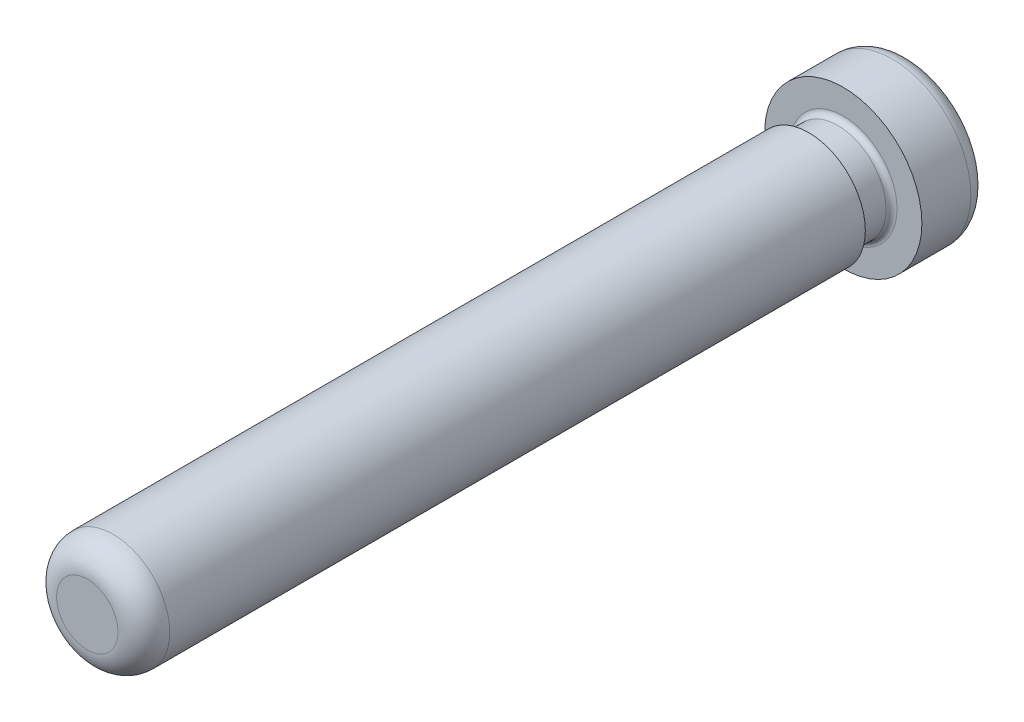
ISO-10303-21;
HEADER;
FILE_DESCRIPTION(('STEP AP214'),'2;1');
FILE_NAME('part.step','',(''),(''),'','','');
FILE_SCHEMA(('AUTOMOTIVE_DESIGN { 1 0 10303 214 1 1 1 1 }'));
ENDSEC;
DATA;
#1=APPLICATION_CONTEXT('core data for automotive mechanical design processes');
#2=APPLICATION_PROTOCOL_DEFINITION('international standard','automotive_design',2000,#1);
#3=PRODUCT_CONTEXT('',#1,'mechanical');
#4=PRODUCT('Part','Part','',(#3));
#5=PRODUCT_RELATED_PRODUCT_CATEGORY('part','',(#4));
#6=PRODUCT_DEFINITION_FORMATION('','',#4);
#7=PRODUCT_DEFINITION_CONTEXT('part definition',#1,'design');
#8=PRODUCT_DEFINITION('design','',#6,#7);
#9=PRODUCT_DEFINITION_SHAPE('','',#8);
#10=(LENGTH_UNIT() NAMED_UNIT(*) SI_UNIT(.MILLI.,.METRE.));
#11=(NAMED_UNIT(*) PLANE_ANGLE_UNIT() SI_UNIT($,.RADIAN.));
#12=(NAMED_UNIT(*) SI_UNIT($,.STERADIAN.) SOLID_ANGLE_UNIT());
#13=UNCERTAINTY_MEASURE_WITH_UNIT(LENGTH_MEASURE(1.E-05),#10,'distance_accuracy_value','');
#14=(GEOMETRIC_REPRESENTATION_CONTEXT(3) GLOBAL_UNCERTAINTY_ASSIGNED_CONTEXT((#13)) GLOBAL_UNIT_ASSIGNED_CONTEXT((#10,
#11,#12)) REPRESENTATION_CONTEXT('',''));
#15=CARTESIAN_POINT('',(0.,0.,0.));
#16=DIRECTION('',(0.,0.,1.));
#17=DIRECTION('',(1.,0.,0.));
#18=AXIS2_PLACEMENT_3D('',#15,#16,#17);
#19=CARTESIAN_POINT('',(0.,1.41287499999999,0.));
#20=DIRECTION('',(0.,0.,-1.));
#21=DIRECTION('',(-1.,0.,0.));
#22=AXIS2_PLACEMENT_3D('',#19,#20,#21);
#23=PLANE('',#22);
#24=CARTESIAN_POINT('',(0.,0.,0.));
#25=DIRECTION('',(0.,0.,1.));
#26=DIRECTION('',(1.,0.,0.));
#27=AXIS2_PLACEMENT_3D('',#24,#25,#26);
#28=CIRCLE('',#27,1.41287499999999);
#29=CARTESIAN_POINT('',(1.41287499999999,0.,0.));
#30=VERTEX_POINT('',#29);
#31=EDGE_CURVE('E67',#30,#30,#28,.T.);
#32=ORIENTED_EDGE('',*,*,#31,.T.);
#33=EDGE_LOOP('',(#32));
#34=FACE_BOUND('',#33,.T.);
#35=ADVANCED_FACE('F33',(#34),#23,.F.);
#36=CARTESIAN_POINT('',(0.,0.,-37.846));
#37=DIRECTION('',(0.,0.,1.));
#38=DIRECTION('',(1.,0.,0.));
#39=AXIS2_PLACEMENT_3D('',#36,#37,#38);
#40=PLANE('',#39);
#41=CARTESIAN_POINT('',(0.,0.,-37.846));
#42=DIRECTION('',(0.,0.,1.));
#43=DIRECTION('',(1.,0.,0.));
#44=AXIS2_PLACEMENT_3D('',#41,#42,#43);
#45=CIRCLE('',#44,2.82574999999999);
#46=CARTESIAN_POINT('',(2.82574999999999,0.,-37.846));
#47=VERTEX_POINT('',#46);
#48=EDGE_CURVE('E10',#47,#47,#45,.T.);
#49=ORIENTED_EDGE('',*,*,#48,.F.);
#50=EDGE_LOOP('',(#49));
#51=FACE_BOUND('',#50,.T.);
#52=ADVANCED_FACE('F121',(#51),#40,.F.);
#53=CARTESIAN_POINT('',(0.,0.,-37.05225));
#54=DIRECTION('',(0.,0.,1.));
#55=DIRECTION('',(1.,0.,0.));
#56=AXIS2_PLACEMENT_3D('',#53,#54,#55);
#57=TOROIDAL_SURFACE('',#56,2.82575,0.793750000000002);
#58=CARTESIAN_POINT('',(0.,0.,-37.05225));
#59=DIRECTION('',(0.,0.,1.));
#60=DIRECTION('',(1.,0.,0.));
#61=AXIS2_PLACEMENT_3D('',#58,#59,#60);
#62=CIRCLE('',#61,3.6195);
#63=CARTESIAN_POINT('',(3.6195,0.,-37.05225));
#64=VERTEX_POINT('',#63);
#65=EDGE_CURVE('E39',#64,#64,#62,.T.);
#66=ORIENTED_EDGE('',*,*,#65,.F.);
#67=EDGE_LOOP('',(#66));
#68=FACE_BOUND('',#67,.T.);
#69=ORIENTED_EDGE('',*,*,#48,.T.);
#70=EDGE_LOOP('',(#69));
#71=FACE_BOUND('',#70,.T.);
#72=ADVANCED_FACE('F116',(#68,#71),#57,.T.);
#73=CARTESIAN_POINT('',(0.,0.,0.));
#74=DIRECTION('',(0.,0.,1.));
#75=DIRECTION('',(1.,0.,0.));
#76=AXIS2_PLACEMENT_3D('',#73,#74,#75);
#77=CYLINDRICAL_SURFACE('',#76,3.6195);
#78=CARTESIAN_POINT('',(0.,0.,-34.798));
#79=DIRECTION('',(0.,0.,1.));
#80=DIRECTION('',(1.,0.,0.));
#81=AXIS2_PLACEMENT_3D('',#78,#79,#80);
#82=CIRCLE('',#81,3.6195);
#83=CARTESIAN_POINT('',(3.6195,0.,-34.798));
#84=VERTEX_POINT('',#83);
#85=EDGE_CURVE('E43',#84,#84,#82,.T.);
#86=ORIENTED_EDGE('',*,*,#85,.F.);
#87=EDGE_LOOP('',(#86));
#88=FACE_BOUND('',#87,.T.);
#89=ORIENTED_EDGE('',*,*,#65,.T.);
#90=EDGE_LOOP('',(#89));
#91=FACE_BOUND('',#90,.T.);
#92=ADVANCED_FACE('F111',(#88,#91),#77,.T.);
#93=CARTESIAN_POINT('',(0.,3.6195,-34.798));
#94=DIRECTION('',(0.,0.,-1.));
#95=DIRECTION('',(-1.,0.,0.));
#96=AXIS2_PLACEMENT_3D('',#93,#94,#95);
#97=PLANE('',#96);
#98=CARTESIAN_POINT('',(0.,0.,-34.798));
#99=DIRECTION('',(0.,0.,1.));
#100=DIRECTION('',(1.,0.,0.));
#101=AXIS2_PLACEMENT_3D('',#98,#99,#100);
#102=CIRCLE('',#101,2.4765);
#103=CARTESIAN_POINT('',(2.4765,0.,-34.798));
#104=VERTEX_POINT('',#103);
#105=EDGE_CURVE('E47',#104,#104,#102,.T.);
#106=ORIENTED_EDGE('',*,*,#105,.F.);
#107=EDGE_LOOP('',(#106));
#108=FACE_BOUND('',#107,.T.);
#109=ORIENTED_EDGE('',*,*,#85,.T.);
#110=EDGE_LOOP('',(#109));
#111=FACE_BOUND('',#110,.T.);
#112=ADVANCED_FACE('F105',(#108,#111),#97,.F.);
#113=CARTESIAN_POINT('',(0.,0.,-34.544));
#114=DIRECTION('',(0.,0.,1.));
#115=DIRECTION('',(1.,0.,0.));
#116=AXIS2_PLACEMENT_3D('',#113,#114,#115);
#117=TOROIDAL_SURFACE('',#116,2.4765,0.253999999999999);
#118=CARTESIAN_POINT('',(0.,0.,-34.544));
#119=DIRECTION('',(0.,0.,1.));
#120=DIRECTION('',(1.,0.,0.));
#121=AXIS2_PLACEMENT_3D('',#118,#119,#120);
#122=CIRCLE('',#121,2.2225);
#123=CARTESIAN_POINT('',(2.2225,0.,-34.544));
#124=VERTEX_POINT('',#123);
#125=EDGE_CURVE('E52',#124,#124,#122,.T.);
#126=ORIENTED_EDGE('',*,*,#125,.F.);
#127=EDGE_LOOP('',(#126));
#128=FACE_BOUND('',#127,.T.);
#129=ORIENTED_EDGE('',*,*,#105,.T.);
#130=EDGE_LOOP('',(#129));
#131=FACE_BOUND('',#130,.T.);
#132=ADVANCED_FACE('F99',(#128,#131),#117,.F.);
#133=CARTESIAN_POINT('',(0.,0.,0.));
#134=DIRECTION('',(0.,0.,1.));
#135=DIRECTION('',(1.,0.,0.));
#136=AXIS2_PLACEMENT_3D('',#133,#134,#135);
#137=CYLINDRICAL_SURFACE('',#136,2.2225);
#138=CARTESIAN_POINT('',(0.,0.,-33.4645));
#139=DIRECTION('',(0.,0.,1.));
#140=DIRECTION('',(1.,0.,0.));
#141=AXIS2_PLACEMENT_3D('',#138,#139,#140);
#142=CIRCLE('',#141,2.2225);
#143=CARTESIAN_POINT('',(2.2225,0.,-33.4645));
#144=VERTEX_POINT('',#143);
#145=EDGE_CURVE('E55',#144,#144,#142,.T.);
#146=ORIENTED_EDGE('',*,*,#145,.F.);
#147=EDGE_LOOP('',(#146));
#148=FACE_BOUND('',#147,.T.);
#149=ORIENTED_EDGE('',*,*,#125,.T.);
#150=EDGE_LOOP('',(#149));
#151=FACE_BOUND('',#150,.T.);
#152=ADVANCED_FACE('F93',(#148,#151),#137,.T.);
#153=CARTESIAN_POINT('',(0.,0.,-33.4645));
#154=DIRECTION('',(0.,0.,1.));
#155=DIRECTION('',(1.,0.,0.));
#156=AXIS2_PLACEMENT_3D('',#153,#154,#155);
#157=TOROIDAL_SURFACE('',#156,2.4765,0.253999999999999);
#158=CARTESIAN_POINT('',(0.,0.,-33.2105));
#159=DIRECTION('',(0.,0.,1.));
#160=DIRECTION('',(1.,0.,0.));
#161=AXIS2_PLACEMENT_3D('',#158,#159,#160);
#162=CIRCLE('',#161,2.4765);
#163=CARTESIAN_POINT('',(2.4765,0.,-33.2105));
#164=VERTEX_POINT('',#163);
#165=EDGE_CURVE('E58',#164,#164,#162,.T.);
#166=ORIENTED_EDGE('',*,*,#165,.F.);
#167=EDGE_LOOP('',(#166));
#168=FACE_BOUND('',#167,.T.);
#169=ORIENTED_EDGE('',*,*,#145,.T.);
#170=EDGE_LOOP('',(#169));
#171=FACE_BOUND('',#170,.T.);
#172=ADVANCED_FACE('F87',(#168,#171),#157,.F.);
#173=CARTESIAN_POINT('',(0.,2.4765,-33.2105));
#174=DIRECTION('',(0.,0.,1.));
#175=DIRECTION('',(1.,0.,0.));
#176=AXIS2_PLACEMENT_3D('',#173,#174,#175);
#177=PLANE('',#176);
#178=CARTESIAN_POINT('',(0.,0.,-33.2105));
#179=DIRECTION('',(0.,0.,1.));
#180=DIRECTION('',(1.,0.,0.));
#181=AXIS2_PLACEMENT_3D('',#178,#179,#180);
#182=CIRCLE('',#181,2.6035);
#183=CARTESIAN_POINT('',(2.6035,0.,-33.2105));
#184=VERTEX_POINT('',#183);
#185=EDGE_CURVE('E61',#184,#184,#182,.T.);
#186=ORIENTED_EDGE('',*,*,#185,.F.);
#187=EDGE_LOOP('',(#186));
#188=FACE_BOUND('',#187,.T.);
#189=ORIENTED_EDGE('',*,*,#165,.T.);
#190=EDGE_LOOP('',(#189));
#191=FACE_BOUND('',#190,.T.);
#192=ADVANCED_FACE('F81',(#188,#191),#177,.F.);
#193=CARTESIAN_POINT('',(0.,0.,0.));
#194=DIRECTION('',(0.,0.,1.));
#195=DIRECTION('',(1.,0.,0.));
#196=AXIS2_PLACEMENT_3D('',#193,#194,#195);
#197=CYLINDRICAL_SURFACE('',#196,2.6035);
#198=CARTESIAN_POINT('',(0.,0.,-1.19062500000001));
#199=DIRECTION('',(0.,0.,1.));
#200=DIRECTION('',(1.,0.,0.));
#201=AXIS2_PLACEMENT_3D('',#198,#199,#200);
#202=CIRCLE('',#201,2.6035);
#203=CARTESIAN_POINT('',(2.6035,0.,-1.19062500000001));
#204=VERTEX_POINT('',#203);
#205=EDGE_CURVE('E64',#204,#204,#202,.T.);
#206=ORIENTED_EDGE('',*,*,#205,.F.);
#207=EDGE_LOOP('',(#206));
#208=FACE_BOUND('',#207,.T.);
#209=ORIENTED_EDGE('',*,*,#185,.T.);
#210=EDGE_LOOP('',(#209));
#211=FACE_BOUND('',#210,.T.);
#212=ADVANCED_FACE('F75',(#208,#211),#197,.T.);
#213=CARTESIAN_POINT('',(0.,0.,-1.190625));
#214=DIRECTION('',(0.,0.,1.));
#215=DIRECTION('',(1.,0.,0.));
#216=AXIS2_PLACEMENT_3D('',#213,#214,#215);
#217=TOROIDAL_SURFACE('',#216,1.412875,1.190625);
#218=ORIENTED_EDGE('',*,*,#31,.F.);
#219=EDGE_LOOP('',(#218));
#220=FACE_BOUND('',#219,.T.);
#221=ORIENTED_EDGE('',*,*,#205,.T.);
#222=EDGE_LOOP('',(#221));
#223=FACE_BOUND('',#222,.T.);
#224=ADVANCED_FACE('F72',(#220,#223),#217,.T.);
#225=CLOSED_SHELL('',(#35,#52,#72,#92,#112,#132,#152,#172,#192,#212,#224));
#226=MANIFOLD_SOLID_BREP('B2',#225);
#227=ADVANCED_BREP_SHAPE_REPRESENTATION('',(#18,#226),#14);
#228=SHAPE_DEFINITION_REPRESENTATION(#9,#227);
ENDSEC;
END-ISO-10303-21;
